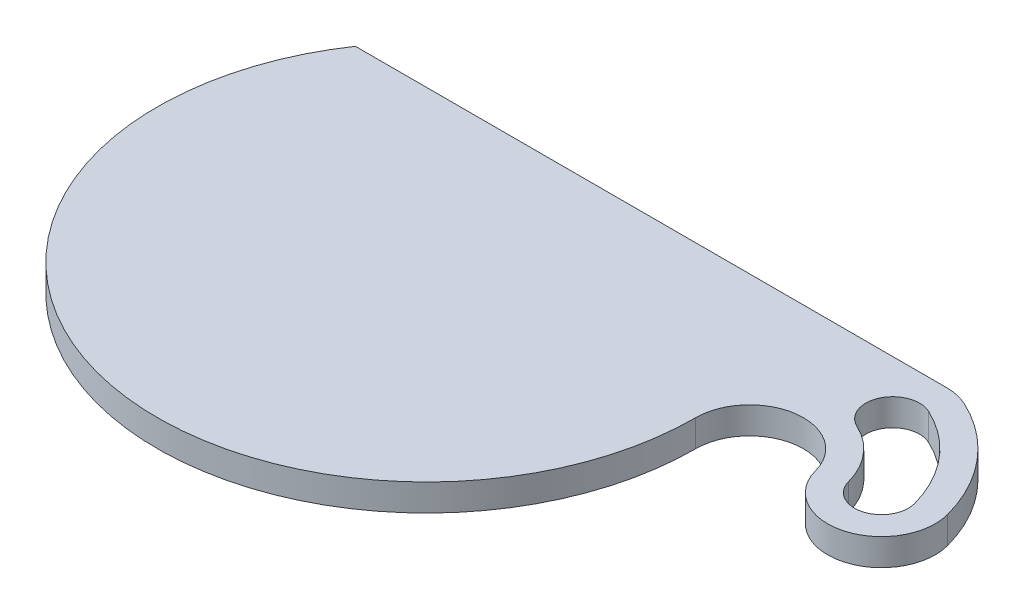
from build123d import *

# Parameters (mm, degrees)
BOSS_EXTRUDE2_DEPTH = 5


with BuildPart() as part:
    # Sketch1 → Boss-Extrude2 (new body)
    # profile 1 of 2: a face of its own
    with BuildSketch(Plane(origin=(0, 0, 0), x_dir=(1, 0, 0), z_dir=(0, 1, 0))):
        with BuildLine():
            ThreePointArc((64.226182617, 9.06307787), (58.689405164, 20.29055188), (68.452365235, 28.126155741))
            Line((68.452365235, 28.126155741), (-41.33907792, 28.126155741))
            ThreePointArc((-41.33907792, 28.126155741), (-14.714722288, -47.785740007), (50, 0))
            ThreePointArc((50, 0), (54.627003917, 8.433914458), (64.226182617, 9.06307787))
        make_face()
    # profile 2 of 2: a face of its own
    with BuildSketch(Plane(origin=(0, 0, 0), x_dir=(1, 0, 0), z_dir=(0, 1, 0))):
        with BuildLine():
            ThreePointArc((72.678547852, 27.189233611), (70.616761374, 27.889115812), (68.452365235, 28.126155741))
            ThreePointArc((68.452365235, 28.126155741), (58.689405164, 20.29055188), (64.226182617, 9.06307787))
            ThreePointArc((64.226182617, 9.06307787), (67.660444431, 6.427876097), (69.659258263, 2.588190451))
            ThreePointArc((69.659258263, 2.588190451), (81.906706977, -4.482877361), (88.977774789, 7.764571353))
            ThreePointArc((88.977774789, 7.764571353), (82.981333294, 19.283628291), (72.678547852, 27.189233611))
        make_face()
        with BuildLine():
            ThreePointArc((70.565456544, 22.657694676), (79.151111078, 16.069690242), (84.148145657, 6.470476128))
            ThreePointArc((84.148145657, 6.470476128), (80.612611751, 0.346751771), (74.488887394, 3.882285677))
            ThreePointArc((74.488887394, 3.882285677), (71.490666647, 9.641814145), (66.339273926, 13.594616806))
            ThreePointArc((66.339273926, 13.594616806), (63.9208263, 20.239247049), (70.565456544, 22.657694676))
        make_face(mode=Mode.SUBTRACT)
    extrude(amount=BOSS_EXTRUDE2_DEPTH)


solid = part.part
